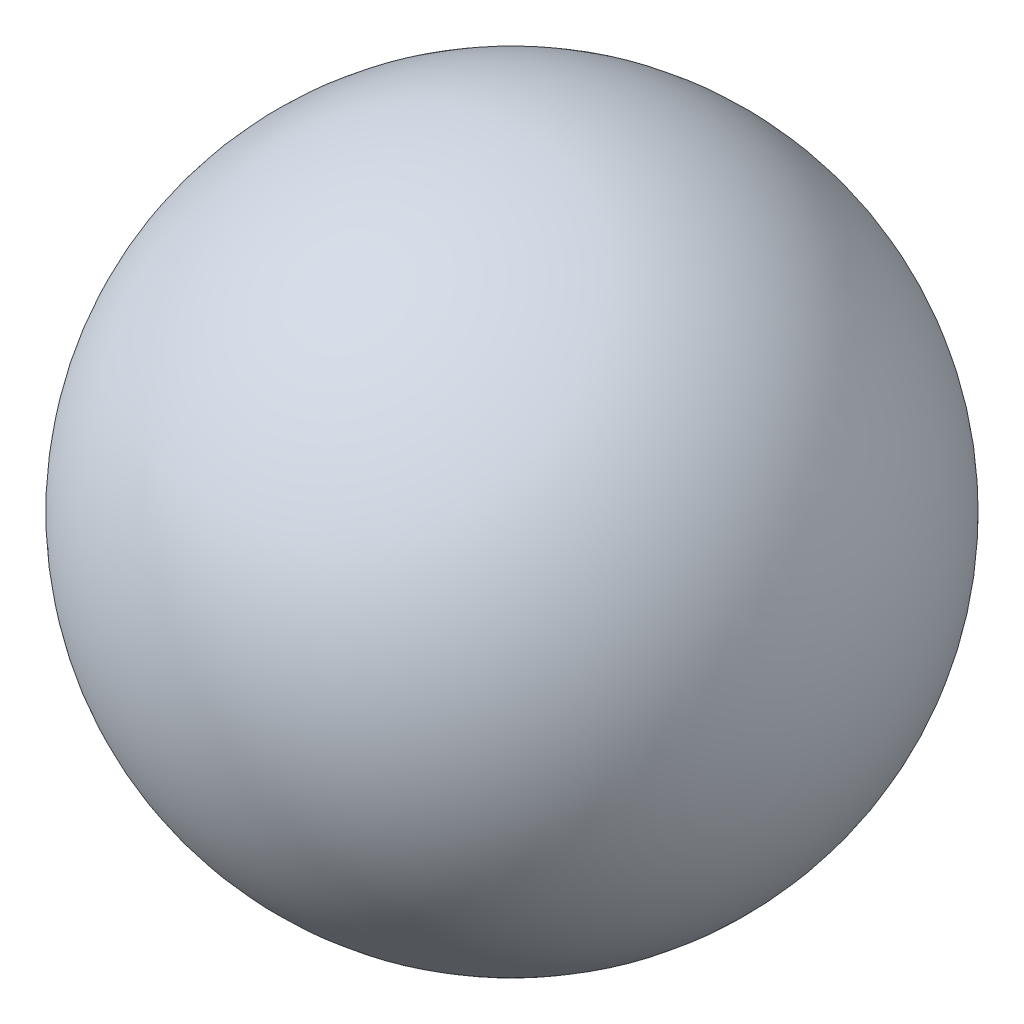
ISO-10303-21;
HEADER;
FILE_DESCRIPTION(('STEP AP214'),'2;1');
FILE_NAME('part.step','',(''),(''),'','','');
FILE_SCHEMA(('AUTOMOTIVE_DESIGN { 1 0 10303 214 1 1 1 1 }'));
ENDSEC;
DATA;
#1=APPLICATION_CONTEXT('core data for automotive mechanical design processes');
#2=APPLICATION_PROTOCOL_DEFINITION('international standard','automotive_design',2000,#1);
#3=PRODUCT_CONTEXT('',#1,'mechanical');
#4=PRODUCT('Part','Part','',(#3));
#5=PRODUCT_RELATED_PRODUCT_CATEGORY('part','',(#4));
#6=PRODUCT_DEFINITION_FORMATION('','',#4);
#7=PRODUCT_DEFINITION_CONTEXT('part definition',#1,'design');
#8=PRODUCT_DEFINITION('design','',#6,#7);
#9=PRODUCT_DEFINITION_SHAPE('','',#8);
#10=(LENGTH_UNIT() NAMED_UNIT(*) SI_UNIT(.MILLI.,.METRE.));
#11=(NAMED_UNIT(*) PLANE_ANGLE_UNIT() SI_UNIT($,.RADIAN.));
#12=(NAMED_UNIT(*) SI_UNIT($,.STERADIAN.) SOLID_ANGLE_UNIT());
#13=UNCERTAINTY_MEASURE_WITH_UNIT(LENGTH_MEASURE(1.E-05),#10,'distance_accuracy_value','');
#14=(GEOMETRIC_REPRESENTATION_CONTEXT(3) GLOBAL_UNCERTAINTY_ASSIGNED_CONTEXT((#13)) GLOBAL_UNIT_ASSIGNED_CONTEXT((#10,
#11,#12)) REPRESENTATION_CONTEXT('',''));
#15=CARTESIAN_POINT('',(0.,0.,0.));
#16=DIRECTION('',(0.,0.,1.));
#17=DIRECTION('',(1.,0.,0.));
#18=AXIS2_PLACEMENT_3D('',#15,#16,#17);
#19=CARTESIAN_POINT('',(0.,0.,0.));
#20=DIRECTION('',(0.,-1.,0.));
#21=DIRECTION('',(1.,0.,0.));
#22=AXIS2_PLACEMENT_3D('',#19,#20,#21);
#23=SPHERICAL_SURFACE('',#22,64.);
#24=CARTESIAN_POINT('',(0.,-62.2173609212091,0.));
#25=DIRECTION('',(0.,-1.,0.));
#26=DIRECTION('',(0.,0.,-1.));
#27=AXIS2_PLACEMENT_3D('',#24,#25,#26);
#28=CIRCLE('',#27,15.);
#29=CARTESIAN_POINT('',(0.,-62.2173609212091,-15.));
#30=VERTEX_POINT('',#29);
#31=EDGE_CURVE('E10',#30,#30,#28,.T.);
#32=ORIENTED_EDGE('',*,*,#31,.T.);
#33=EDGE_LOOP('',(#32));
#34=FACE_BOUND('',#33,.T.);
#35=ADVANCED_FACE('F38',(#34),#23,.F.);
#36=CARTESIAN_POINT('',(0.,-64.,0.));
#37=DIRECTION('',(0.,-1.,0.));
#38=DIRECTION('',(0.,0.,-1.));
#39=AXIS2_PLACEMENT_3D('',#36,#37,#38);
#40=CYLINDRICAL_SURFACE('',#39,15.);
#41=CARTESIAN_POINT('',(0.,-65.8122329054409,0.));
#42=DIRECTION('',(0.,-1.,0.));
#43=DIRECTION('',(0.,0.,-1.));
#44=AXIS2_PLACEMENT_3D('',#41,#42,#43);
#45=CIRCLE('',#44,15.);
#46=CARTESIAN_POINT('',(0.,-65.8122329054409,-15.));
#47=VERTEX_POINT('',#46);
#48=EDGE_CURVE('E44',#47,#47,#45,.T.);
#49=ORIENTED_EDGE('',*,*,#48,.T.);
#50=EDGE_LOOP('',(#49));
#51=FACE_BOUND('',#50,.T.);
#52=ORIENTED_EDGE('',*,*,#31,.F.);
#53=EDGE_LOOP('',(#52));
#54=FACE_BOUND('',#53,.T.);
#55=ADVANCED_FACE('F50',(#51,#54),#40,.F.);
#56=CARTESIAN_POINT('',(0.,0.,0.));
#57=DIRECTION('',(0.,-1.,0.));
#58=DIRECTION('',(1.,0.,0.));
#59=AXIS2_PLACEMENT_3D('',#56,#57,#58);
#60=SPHERICAL_SURFACE('',#59,67.5);
#61=ORIENTED_EDGE('',*,*,#48,.F.);
#62=EDGE_LOOP('',(#61));
#63=FACE_BOUND('',#62,.T.);
#64=ADVANCED_FACE('F53',(#63),#60,.T.);
#65=CLOSED_SHELL('',(#35,#55,#64));
#66=MANIFOLD_SOLID_BREP('B2',#65);
#67=ADVANCED_BREP_SHAPE_REPRESENTATION('',(#18,#66),#14);
#68=SHAPE_DEFINITION_REPRESENTATION(#9,#67);
ENDSEC;
END-ISO-10303-21;
